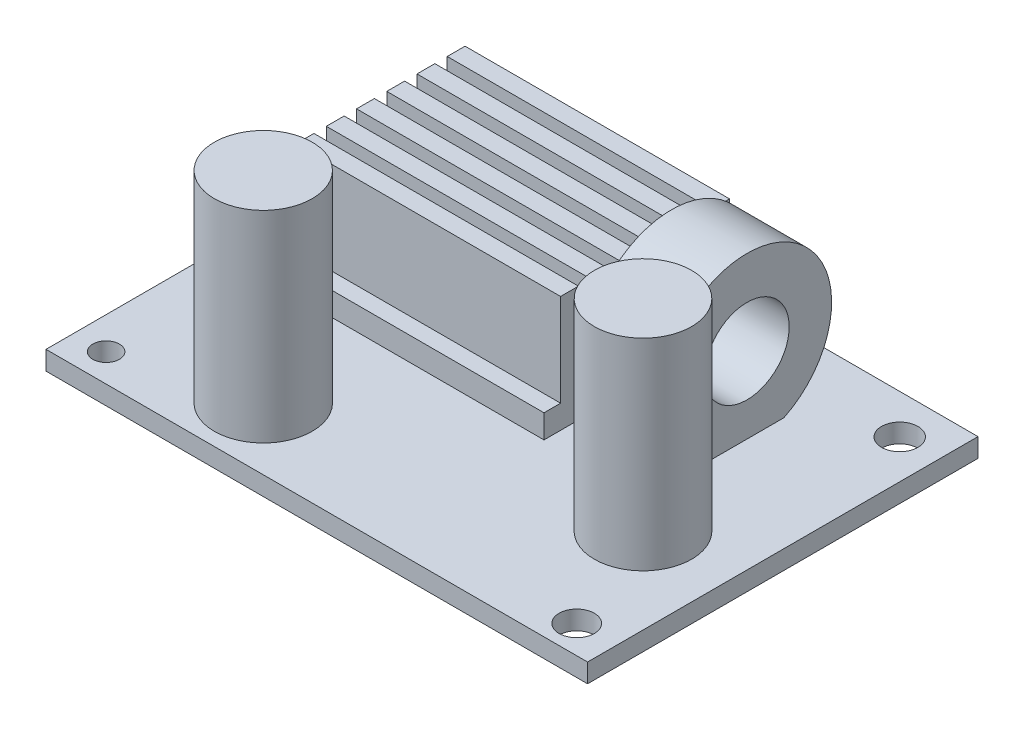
ISO-10303-21;
HEADER;
FILE_DESCRIPTION(('STEP AP214'),'2;1');
FILE_NAME('part.step','',(''),(''),'','','');
FILE_SCHEMA(('AUTOMOTIVE_DESIGN { 1 0 10303 214 1 1 1 1 }'));
ENDSEC;
DATA;
#1=APPLICATION_CONTEXT('core data for automotive mechanical design processes');
#2=APPLICATION_PROTOCOL_DEFINITION('international standard','automotive_design',2000,#1);
#3=PRODUCT_CONTEXT('',#1,'mechanical');
#4=PRODUCT('Part','Part','',(#3));
#5=PRODUCT_RELATED_PRODUCT_CATEGORY('part','',(#4));
#6=PRODUCT_DEFINITION_FORMATION('','',#4);
#7=PRODUCT_DEFINITION_CONTEXT('part definition',#1,'design');
#8=PRODUCT_DEFINITION('design','',#6,#7);
#9=PRODUCT_DEFINITION_SHAPE('','',#8);
#10=(LENGTH_UNIT() NAMED_UNIT(*) SI_UNIT(.MILLI.,.METRE.));
#11=(NAMED_UNIT(*) PLANE_ANGLE_UNIT() SI_UNIT($,.RADIAN.));
#12=(NAMED_UNIT(*) SI_UNIT($,.STERADIAN.) SOLID_ANGLE_UNIT());
#13=UNCERTAINTY_MEASURE_WITH_UNIT(LENGTH_MEASURE(1.E-05),#10,'distance_accuracy_value','');
#14=(GEOMETRIC_REPRESENTATION_CONTEXT(3) GLOBAL_UNCERTAINTY_ASSIGNED_CONTEXT((#13)) GLOBAL_UNIT_ASSIGNED_CONTEXT((#10,
#11,#12)) REPRESENTATION_CONTEXT('',''));
#15=CARTESIAN_POINT('',(0.,0.,0.));
#16=DIRECTION('',(0.,0.,1.));
#17=DIRECTION('',(1.,0.,0.));
#18=AXIS2_PLACEMENT_3D('',#15,#16,#17);
#19=CARTESIAN_POINT('',(0.,1.5,0.));
#20=DIRECTION('',(0.,1.,0.));
#21=DIRECTION('',(0.,0.,1.));
#22=AXIS2_PLACEMENT_3D('',#19,#20,#21);
#23=PLANE('',#22);
#24=DIRECTION('',(0.,0.,1.));
#25=VECTOR('',#24,1.);
#26=CARTESIAN_POINT('',(4.5,1.5,-10.0409728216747));
#27=LINE('',#26,#25);
#28=CARTESIAN_POINT('',(4.5,1.5,-12.7734342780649));
#29=VERTEX_POINT('',#28);
#30=CARTESIAN_POINT('',(4.5,1.5,1.95902717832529));
#31=VERTEX_POINT('',#30);
#32=EDGE_CURVE('E334',#29,#31,#27,.T.);
#33=ORIENTED_EDGE('',*,*,#32,.T.);
#34=DIRECTION('',(-1.,0.,0.));
#35=VECTOR('',#34,1.);
#36=CARTESIAN_POINT('',(4.5,1.5,1.95902717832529));
#37=LINE('',#36,#35);
#38=CARTESIAN_POINT('',(-16.5,1.5,1.95902717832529));
#39=VERTEX_POINT('',#38);
#40=EDGE_CURVE('E478',#31,#39,#37,.T.);
#41=ORIENTED_EDGE('',*,*,#40,.T.);
#42=DIRECTION('',(0.,0.,1.));
#43=VECTOR('',#42,1.);
#44=CARTESIAN_POINT('',(-16.5,1.5,-10.0409728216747));
#45=LINE('',#44,#43);
#46=CARTESIAN_POINT('',(-16.5,1.5,-12.7734342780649));
#47=VERTEX_POINT('',#46);
#48=EDGE_CURVE('E342',#47,#39,#45,.T.);
#49=ORIENTED_EDGE('',*,*,#48,.F.);
#50=DIRECTION('',(-1.,0.,0.));
#51=VECTOR('',#50,1.);
#52=CARTESIAN_POINT('',(4.5,1.5,-12.7734342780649));
#53=LINE('',#52,#51);
#54=EDGE_CURVE('E321',#29,#47,#53,.T.);
#55=ORIENTED_EDGE('',*,*,#54,.F.);
#56=EDGE_LOOP('',(#33,#41,#49,#55));
#57=FACE_BOUND('',#56,.T.);
#58=CARTESIAN_POINT('',(-9.17864919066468,1.5,10.5714292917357));
#59=DIRECTION('',(0.,1.,0.));
#60=DIRECTION('',(0.,0.,1.));
#61=AXIS2_PLACEMENT_3D('',#58,#59,#60);
#62=CIRCLE('',#61,3.88581381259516);
#63=CARTESIAN_POINT('',(-9.17864919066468,1.5,14.4572431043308));
#64=VERTEX_POINT('',#63);
#65=EDGE_CURVE('E318',#64,#64,#62,.T.);
#66=ORIENTED_EDGE('',*,*,#65,.F.);
#67=EDGE_LOOP('',(#66));
#68=FACE_BOUND('',#67,.T.);
#69=CARTESIAN_POINT('',(14.7015779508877,1.5,4.30105538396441));
#70=DIRECTION('',(0.,1.,0.));
#71=DIRECTION('',(0.,0.,1.));
#72=AXIS2_PLACEMENT_3D('',#69,#70,#71);
#73=CIRCLE('',#72,3.86516537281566);
#74=CARTESIAN_POINT('',(14.7015779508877,1.5,8.16622075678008));
#75=VERTEX_POINT('',#74);
#76=EDGE_CURVE('E312',#75,#75,#73,.T.);
#77=ORIENTED_EDGE('',*,*,#76,.F.);
#78=EDGE_LOOP('',(#77));
#79=FACE_BOUND('',#78,.T.);
#80=CARTESIAN_POINT('',(18.4124566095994,1.5,13.2740966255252));
#81=DIRECTION('',(0.,1.,0.));
#82=DIRECTION('',(0.,0.,1.));
#83=AXIS2_PLACEMENT_3D('',#80,#81,#82);
#84=CIRCLE('',#83,1.39691287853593);
#85=CARTESIAN_POINT('',(18.4124566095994,1.5,14.6710095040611));
#86=VERTEX_POINT('',#85);
#87=EDGE_CURVE('E297',#86,#86,#84,.T.);
#88=ORIENTED_EDGE('',*,*,#87,.F.);
#89=EDGE_LOOP('',(#88));
#90=FACE_BOUND('',#89,.T.);
#91=CARTESIAN_POINT('',(-18.9522512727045,1.5,-12.8228525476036));
#92=DIRECTION('',(0.,1.,0.));
#93=DIRECTION('',(0.,0.,1.));
#94=AXIS2_PLACEMENT_3D('',#91,#92,#93);
#95=CIRCLE('',#94,1.38062335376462);
#96=CARTESIAN_POINT('',(-18.9522512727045,1.5,-11.442229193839));
#97=VERTEX_POINT('',#96);
#98=EDGE_CURVE('E280',#97,#97,#95,.T.);
#99=ORIENTED_EDGE('',*,*,#98,.F.);
#100=EDGE_LOOP('',(#99));
#101=FACE_BOUND('',#100,.T.);
#102=DIRECTION('',(0.,0.,1.));
#103=VECTOR('',#102,1.);
#104=CARTESIAN_POINT('',(-21.5,1.5,-15.5));
#105=LINE('',#104,#103);
#106=CARTESIAN_POINT('',(-21.5,1.5,-15.5));
#107=VERTEX_POINT('',#106);
#108=CARTESIAN_POINT('',(-21.5,1.5,15.5));
#109=VERTEX_POINT('',#108);
#110=EDGE_CURVE('E272',#107,#109,#105,.T.);
#111=ORIENTED_EDGE('',*,*,#110,.T.);
#112=DIRECTION('',(1.,0.,0.));
#113=VECTOR('',#112,1.);
#114=CARTESIAN_POINT('',(-21.5,1.5,15.5));
#115=LINE('',#114,#113);
#116=CARTESIAN_POINT('',(21.5,1.5,15.5));
#117=VERTEX_POINT('',#116);
#118=EDGE_CURVE('E284',#109,#117,#115,.T.);
#119=ORIENTED_EDGE('',*,*,#118,.T.);
#120=DIRECTION('',(0.,0.,-1.));
#121=VECTOR('',#120,1.);
#122=CARTESIAN_POINT('',(21.5,1.5,-15.5));
#123=LINE('',#122,#121);
#124=CARTESIAN_POINT('',(21.5,1.5,-15.5));
#125=VERTEX_POINT('',#124);
#126=EDGE_CURVE('E282',#117,#125,#123,.T.);
#127=ORIENTED_EDGE('',*,*,#126,.T.);
#128=DIRECTION('',(-1.,0.,0.));
#129=VECTOR('',#128,1.);
#130=CARTESIAN_POINT('',(-21.5,1.5,-15.5));
#131=LINE('',#130,#129);
#132=EDGE_CURVE('E269',#125,#107,#131,.T.);
#133=ORIENTED_EDGE('',*,*,#132,.T.);
#134=EDGE_LOOP('',(#111,#119,#127,#133));
#135=FACE_BOUND('',#134,.T.);
#136=CARTESIAN_POINT('',(-18.9522512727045,1.5,13.2740966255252));
#137=DIRECTION('',(0.,1.,0.));
#138=DIRECTION('',(0.,0.,1.));
#139=AXIS2_PLACEMENT_3D('',#136,#137,#138);
#140=CIRCLE('',#139,1.05290284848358);
#141=CARTESIAN_POINT('',(-18.9522512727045,1.5,14.3269994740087));
#142=VERTEX_POINT('',#141);
#143=EDGE_CURVE('E291',#142,#142,#140,.T.);
#144=ORIENTED_EDGE('',*,*,#143,.F.);
#145=EDGE_LOOP('',(#144));
#146=FACE_BOUND('',#145,.T.);
#147=CARTESIAN_POINT('',(18.4124566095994,1.5,-12.3716084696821));
#148=DIRECTION('',(0.,1.,0.));
#149=DIRECTION('',(0.,0.,1.));
#150=AXIS2_PLACEMENT_3D('',#147,#148,#149);
#151=CIRCLE('',#150,1.44468594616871);
#152=CARTESIAN_POINT('',(18.4124566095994,1.5,-10.9269225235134));
#153=VERTEX_POINT('',#152);
#154=EDGE_CURVE('E303',#153,#153,#151,.T.);
#155=ORIENTED_EDGE('',*,*,#154,.F.);
#156=EDGE_LOOP('',(#155));
#157=FACE_BOUND('',#156,.T.);
#158=DIRECTION('',(0.,0.,-1.));
#159=VECTOR('',#158,1.);
#160=CARTESIAN_POINT('',(6.5,1.5,0.));
#161=LINE('',#160,#159);
#162=CARTESIAN_POINT('',(6.5,1.5,-3.22295721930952));
#163=VERTEX_POINT('',#162);
#164=CARTESIAN_POINT('',(6.5,1.5,-9.0895799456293));
#165=VERTEX_POINT('',#164);
#166=EDGE_CURVE('E248',#163,#165,#161,.T.);
#167=ORIENTED_EDGE('',*,*,#166,.T.);
#168=DIRECTION('',(-1.,0.,0.));
#169=VECTOR('',#168,1.);
#170=CARTESIAN_POINT('',(12.5,1.5,-9.0895799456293));
#171=LINE('',#170,#169);
#172=CARTESIAN_POINT('',(12.5,1.5,-9.0895799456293));
#173=VERTEX_POINT('',#172);
#174=EDGE_CURVE('E11',#165,#173,#171,.F.);
#175=ORIENTED_EDGE('',*,*,#174,.T.);
#176=DIRECTION('',(0.,0.,-1.));
#177=VECTOR('',#176,1.);
#178=CARTESIAN_POINT('',(12.5,1.5,0.));
#179=LINE('',#178,#177);
#180=CARTESIAN_POINT('',(12.5,1.5,-3.22295721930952));
#181=VERTEX_POINT('',#180);
#182=EDGE_CURVE('E40',#181,#173,#179,.T.);
#183=ORIENTED_EDGE('',*,*,#182,.F.);
#184=DIRECTION('',(-1.,0.,0.));
#185=VECTOR('',#184,1.);
#186=CARTESIAN_POINT('',(12.5,1.5,-3.22295721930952));
#187=LINE('',#186,#185);
#188=EDGE_CURVE('E241',#181,#163,#187,.T.);
#189=ORIENTED_EDGE('',*,*,#188,.T.);
#190=EDGE_LOOP('',(#167,#175,#183,#189));
#191=FACE_BOUND('',#190,.T.);
#192=ADVANCED_FACE('F32',(#57,#68,#79,#90,#101,#135,#146,#157,#191),#23,.T.);
#193=CARTESIAN_POINT('',(0.,0.,0.));
#194=DIRECTION('',(0.,1.,0.));
#195=DIRECTION('',(0.,0.,1.));
#196=AXIS2_PLACEMENT_3D('',#193,#194,#195);
#197=PLANE('',#196);
#198=DIRECTION('',(0.,0.,1.));
#199=VECTOR('',#198,1.);
#200=CARTESIAN_POINT('',(-21.5,0.,-15.5));
#201=LINE('',#200,#199);
#202=CARTESIAN_POINT('',(-21.5,0.,-15.5));
#203=VERTEX_POINT('',#202);
#204=CARTESIAN_POINT('',(-21.5,0.,15.5));
#205=VERTEX_POINT('',#204);
#206=EDGE_CURVE('E277',#203,#205,#201,.T.);
#207=ORIENTED_EDGE('',*,*,#206,.F.);
#208=DIRECTION('',(-1.,0.,0.));
#209=VECTOR('',#208,1.);
#210=CARTESIAN_POINT('',(-21.5,0.,-15.5));
#211=LINE('',#210,#209);
#212=CARTESIAN_POINT('',(21.5,0.,-15.5));
#213=VERTEX_POINT('',#212);
#214=EDGE_CURVE('E270',#213,#203,#211,.T.);
#215=ORIENTED_EDGE('',*,*,#214,.F.);
#216=DIRECTION('',(0.,0.,-1.));
#217=VECTOR('',#216,1.);
#218=CARTESIAN_POINT('',(21.5,0.,-15.5));
#219=LINE('',#218,#217);
#220=CARTESIAN_POINT('',(21.5,0.,15.5));
#221=VERTEX_POINT('',#220);
#222=EDGE_CURVE('E273',#221,#213,#219,.T.);
#223=ORIENTED_EDGE('',*,*,#222,.F.);
#224=DIRECTION('',(1.,0.,0.));
#225=VECTOR('',#224,1.);
#226=CARTESIAN_POINT('',(-21.5,0.,15.5));
#227=LINE('',#226,#225);
#228=EDGE_CURVE('E275',#205,#221,#227,.T.);
#229=ORIENTED_EDGE('',*,*,#228,.F.);
#230=EDGE_LOOP('',(#207,#215,#223,#229));
#231=FACE_BOUND('',#230,.T.);
#232=CARTESIAN_POINT('',(-18.9522512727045,0.,-12.8228525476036));
#233=DIRECTION('',(0.,1.,0.));
#234=DIRECTION('',(0.,0.,1.));
#235=AXIS2_PLACEMENT_3D('',#232,#233,#234);
#236=CIRCLE('',#235,1.38062335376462);
#237=CARTESIAN_POINT('',(-18.9522512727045,0.,-11.442229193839));
#238=VERTEX_POINT('',#237);
#239=EDGE_CURVE('E288',#238,#238,#236,.T.);
#240=ORIENTED_EDGE('',*,*,#239,.T.);
#241=EDGE_LOOP('',(#240));
#242=FACE_BOUND('',#241,.T.);
#243=CARTESIAN_POINT('',(-18.9522512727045,0.,13.2740966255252));
#244=DIRECTION('',(0.,1.,0.));
#245=DIRECTION('',(0.,0.,1.));
#246=AXIS2_PLACEMENT_3D('',#243,#244,#245);
#247=CIRCLE('',#246,1.05290284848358);
#248=CARTESIAN_POINT('',(-18.9522512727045,0.,14.3269994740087));
#249=VERTEX_POINT('',#248);
#250=EDGE_CURVE('E294',#249,#249,#247,.T.);
#251=ORIENTED_EDGE('',*,*,#250,.T.);
#252=EDGE_LOOP('',(#251));
#253=FACE_BOUND('',#252,.T.);
#254=CARTESIAN_POINT('',(18.4124566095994,0.,13.2740966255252));
#255=DIRECTION('',(0.,1.,0.));
#256=DIRECTION('',(0.,0.,1.));
#257=AXIS2_PLACEMENT_3D('',#254,#255,#256);
#258=CIRCLE('',#257,1.39691287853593);
#259=CARTESIAN_POINT('',(18.4124566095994,0.,14.6710095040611));
#260=VERTEX_POINT('',#259);
#261=EDGE_CURVE('E300',#260,#260,#258,.T.);
#262=ORIENTED_EDGE('',*,*,#261,.T.);
#263=EDGE_LOOP('',(#262));
#264=FACE_BOUND('',#263,.T.);
#265=CARTESIAN_POINT('',(18.4124566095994,0.,-12.3716084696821));
#266=DIRECTION('',(0.,1.,0.));
#267=DIRECTION('',(0.,0.,1.));
#268=AXIS2_PLACEMENT_3D('',#265,#266,#267);
#269=CIRCLE('',#268,1.44468594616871);
#270=CARTESIAN_POINT('',(18.4124566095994,0.,-10.9269225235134));
#271=VERTEX_POINT('',#270);
#272=EDGE_CURVE('E306',#271,#271,#269,.T.);
#273=ORIENTED_EDGE('',*,*,#272,.T.);
#274=EDGE_LOOP('',(#273));
#275=FACE_BOUND('',#274,.T.);
#276=ADVANCED_FACE('F541',(#231,#242,#253,#264,#275),#197,.F.);
#277=CARTESIAN_POINT('',(-21.5,1.5,-15.5));
#278=DIRECTION('',(1.,0.,0.));
#279=DIRECTION('',(0.,0.,-1.));
#280=AXIS2_PLACEMENT_3D('',#277,#278,#279);
#281=PLANE('',#280);
#282=ORIENTED_EDGE('',*,*,#206,.T.);
#283=DIRECTION('',(0.,-1.,0.));
#284=VECTOR('',#283,1.);
#285=CARTESIAN_POINT('',(-21.5,1.5,15.5));
#286=LINE('',#285,#284);
#287=EDGE_CURVE('E249',#109,#205,#286,.T.);
#288=ORIENTED_EDGE('',*,*,#287,.F.);
#289=ORIENTED_EDGE('',*,*,#110,.F.);
#290=DIRECTION('',(0.,-1.,0.));
#291=VECTOR('',#290,1.);
#292=CARTESIAN_POINT('',(-21.5,1.5,-15.5));
#293=LINE('',#292,#291);
#294=EDGE_CURVE('E266',#107,#203,#293,.T.);
#295=ORIENTED_EDGE('',*,*,#294,.T.);
#296=EDGE_LOOP('',(#282,#288,#289,#295));
#297=FACE_BOUND('',#296,.T.);
#298=ADVANCED_FACE('F34',(#297),#281,.F.);
#299=CARTESIAN_POINT('',(-21.5,1.5,15.5));
#300=DIRECTION('',(0.,0.,-1.));
#301=DIRECTION('',(-1.,0.,0.));
#302=AXIS2_PLACEMENT_3D('',#299,#300,#301);
#303=PLANE('',#302);
#304=ORIENTED_EDGE('',*,*,#228,.T.);
#305=DIRECTION('',(0.,-1.,0.));
#306=VECTOR('',#305,1.);
#307=CARTESIAN_POINT('',(21.5,1.5,15.5));
#308=LINE('',#307,#306);
#309=EDGE_CURVE('E260',#117,#221,#308,.T.);
#310=ORIENTED_EDGE('',*,*,#309,.F.);
#311=ORIENTED_EDGE('',*,*,#118,.F.);
#312=ORIENTED_EDGE('',*,*,#287,.T.);
#313=EDGE_LOOP('',(#304,#310,#311,#312));
#314=FACE_BOUND('',#313,.T.);
#315=ADVANCED_FACE('F560',(#314),#303,.F.);
#316=CARTESIAN_POINT('',(21.5,1.5,-15.5));
#317=DIRECTION('',(-1.,0.,0.));
#318=DIRECTION('',(0.,0.,1.));
#319=AXIS2_PLACEMENT_3D('',#316,#317,#318);
#320=PLANE('',#319);
#321=ORIENTED_EDGE('',*,*,#222,.T.);
#322=DIRECTION('',(0.,-1.,0.));
#323=VECTOR('',#322,1.);
#324=CARTESIAN_POINT('',(21.5,1.5,-15.5));
#325=LINE('',#324,#323);
#326=EDGE_CURVE('E263',#125,#213,#325,.T.);
#327=ORIENTED_EDGE('',*,*,#326,.F.);
#328=ORIENTED_EDGE('',*,*,#126,.F.);
#329=ORIENTED_EDGE('',*,*,#309,.T.);
#330=EDGE_LOOP('',(#321,#327,#328,#329));
#331=FACE_BOUND('',#330,.T.);
#332=ADVANCED_FACE('F557',(#331),#320,.F.);
#333=CARTESIAN_POINT('',(-21.5,1.5,-15.5));
#334=DIRECTION('',(0.,0.,1.));
#335=DIRECTION('',(1.,0.,0.));
#336=AXIS2_PLACEMENT_3D('',#333,#334,#335);
#337=PLANE('',#336);
#338=ORIENTED_EDGE('',*,*,#214,.T.);
#339=ORIENTED_EDGE('',*,*,#294,.F.);
#340=ORIENTED_EDGE('',*,*,#132,.F.);
#341=ORIENTED_EDGE('',*,*,#326,.T.);
#342=EDGE_LOOP('',(#338,#339,#340,#341));
#343=FACE_BOUND('',#342,.T.);
#344=ADVANCED_FACE('F554',(#343),#337,.F.);
#345=CARTESIAN_POINT('',(-18.9522512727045,1.5,-12.8228525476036));
#346=DIRECTION('',(0.,-1.,0.));
#347=DIRECTION('',(0.,0.,-1.));
#348=AXIS2_PLACEMENT_3D('',#345,#346,#347);
#349=CYLINDRICAL_SURFACE('',#348,1.38062335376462);
#350=ORIENTED_EDGE('',*,*,#98,.T.);
#351=EDGE_LOOP('',(#350));
#352=FACE_BOUND('',#351,.T.);
#353=ORIENTED_EDGE('',*,*,#239,.F.);
#354=EDGE_LOOP('',(#353));
#355=FACE_BOUND('',#354,.T.);
#356=ADVANCED_FACE('F551',(#352,#355),#349,.F.);
#357=CARTESIAN_POINT('',(-18.9522512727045,1.5,13.2740966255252));
#358=DIRECTION('',(0.,-1.,0.));
#359=DIRECTION('',(0.,0.,-1.));
#360=AXIS2_PLACEMENT_3D('',#357,#358,#359);
#361=CYLINDRICAL_SURFACE('',#360,1.05290284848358);
#362=ORIENTED_EDGE('',*,*,#143,.T.);
#363=EDGE_LOOP('',(#362));
#364=FACE_BOUND('',#363,.T.);
#365=ORIENTED_EDGE('',*,*,#250,.F.);
#366=EDGE_LOOP('',(#365));
#367=FACE_BOUND('',#366,.T.);
#368=ADVANCED_FACE('F600',(#364,#367),#361,.F.);
#369=CARTESIAN_POINT('',(18.4124566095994,1.5,13.2740966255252));
#370=DIRECTION('',(0.,-1.,0.));
#371=DIRECTION('',(0.,0.,-1.));
#372=AXIS2_PLACEMENT_3D('',#369,#370,#371);
#373=CYLINDRICAL_SURFACE('',#372,1.39691287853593);
#374=ORIENTED_EDGE('',*,*,#87,.T.);
#375=EDGE_LOOP('',(#374));
#376=FACE_BOUND('',#375,.T.);
#377=ORIENTED_EDGE('',*,*,#261,.F.);
#378=EDGE_LOOP('',(#377));
#379=FACE_BOUND('',#378,.T.);
#380=ADVANCED_FACE('F589',(#376,#379),#373,.F.);
#381=CARTESIAN_POINT('',(18.4124566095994,1.5,-12.3716084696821));
#382=DIRECTION('',(0.,-1.,0.));
#383=DIRECTION('',(0.,0.,-1.));
#384=AXIS2_PLACEMENT_3D('',#381,#382,#383);
#385=CYLINDRICAL_SURFACE('',#384,1.44468594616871);
#386=ORIENTED_EDGE('',*,*,#154,.T.);
#387=EDGE_LOOP('',(#386));
#388=FACE_BOUND('',#387,.T.);
#389=ORIENTED_EDGE('',*,*,#272,.F.);
#390=EDGE_LOOP('',(#389));
#391=FACE_BOUND('',#390,.T.);
#392=ADVANCED_FACE('F585',(#388,#391),#385,.F.);
#393=CARTESIAN_POINT('',(14.7015779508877,17.5,4.30105538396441));
#394=DIRECTION('',(0.,-1.,0.));
#395=DIRECTION('',(0.,0.,-1.));
#396=AXIS2_PLACEMENT_3D('',#393,#394,#395);
#397=CYLINDRICAL_SURFACE('',#396,3.86516537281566);
#398=CARTESIAN_POINT('',(14.7015779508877,17.5,4.30105538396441));
#399=DIRECTION('',(0.,1.,0.));
#400=DIRECTION('',(0.,0.,1.));
#401=AXIS2_PLACEMENT_3D('',#398,#399,#400);
#402=CIRCLE('',#401,3.86516537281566);
#403=CARTESIAN_POINT('',(14.7015779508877,17.5,8.16622075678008));
#404=VERTEX_POINT('',#403);
#405=EDGE_CURVE('E309',#404,#404,#402,.T.);
#406=ORIENTED_EDGE('',*,*,#405,.F.);
#407=EDGE_LOOP('',(#406));
#408=FACE_BOUND('',#407,.T.);
#409=ORIENTED_EDGE('',*,*,#76,.T.);
#410=EDGE_LOOP('',(#409));
#411=FACE_BOUND('',#410,.T.);
#412=ADVANCED_FACE('F588',(#408,#411),#397,.T.);
#413=CARTESIAN_POINT('',(14.7015779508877,17.5,4.30105538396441));
#414=DIRECTION('',(0.,1.,0.));
#415=DIRECTION('',(0.,0.,1.));
#416=AXIS2_PLACEMENT_3D('',#413,#414,#415);
#417=PLANE('',#416);
#418=ORIENTED_EDGE('',*,*,#405,.T.);
#419=EDGE_LOOP('',(#418));
#420=FACE_BOUND('',#419,.T.);
#421=ADVANCED_FACE('F597',(#420),#417,.T.);
#422=CARTESIAN_POINT('',(-9.17864919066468,17.5,10.5714292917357));
#423=DIRECTION('',(0.,-1.,0.));
#424=DIRECTION('',(0.,0.,-1.));
#425=AXIS2_PLACEMENT_3D('',#422,#423,#424);
#426=CYLINDRICAL_SURFACE('',#425,3.88581381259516);
#427=CARTESIAN_POINT('',(-9.17864919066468,17.5,10.5714292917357));
#428=DIRECTION('',(0.,1.,0.));
#429=DIRECTION('',(0.,0.,1.));
#430=AXIS2_PLACEMENT_3D('',#427,#428,#429);
#431=CIRCLE('',#430,3.88581381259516);
#432=CARTESIAN_POINT('',(-9.17864919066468,17.5,14.4572431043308));
#433=VERTEX_POINT('',#432);
#434=EDGE_CURVE('E315',#433,#433,#431,.T.);
#435=ORIENTED_EDGE('',*,*,#434,.F.);
#436=EDGE_LOOP('',(#435));
#437=FACE_BOUND('',#436,.T.);
#438=ORIENTED_EDGE('',*,*,#65,.T.);
#439=EDGE_LOOP('',(#438));
#440=FACE_BOUND('',#439,.T.);
#441=ADVANCED_FACE('F678',(#437,#440),#426,.T.);
#442=CARTESIAN_POINT('',(-9.17864919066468,17.5,10.5714292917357));
#443=DIRECTION('',(0.,1.,0.));
#444=DIRECTION('',(0.,0.,1.));
#445=AXIS2_PLACEMENT_3D('',#442,#443,#444);
#446=PLANE('',#445);
#447=ORIENTED_EDGE('',*,*,#434,.T.);
#448=EDGE_LOOP('',(#447));
#449=FACE_BOUND('',#448,.T.);
#450=ADVANCED_FACE('F686',(#449),#446,.T.);
#451=CARTESIAN_POINT('',(4.5,1.5,-12.7734342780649));
#452=DIRECTION('',(0.,0.,-1.));
#453=DIRECTION('',(-1.,0.,0.));
#454=AXIS2_PLACEMENT_3D('',#451,#452,#453);
#455=PLANE('',#454);
#456=DIRECTION('',(0.,-1.,0.));
#457=VECTOR('',#456,1.);
#458=CARTESIAN_POINT('',(-16.5,1.5,-12.7734342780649));
#459=LINE('',#458,#457);
#460=CARTESIAN_POINT('',(-16.5,10.7088127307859,-12.7734342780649));
#461=VERTEX_POINT('',#460);
#462=EDGE_CURVE('E55',#461,#47,#459,.T.);
#463=ORIENTED_EDGE('',*,*,#462,.F.);
#464=DIRECTION('',(-1.,0.,0.));
#465=VECTOR('',#464,1.);
#466=CARTESIAN_POINT('',(4.5,10.7088127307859,-12.7734342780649));
#467=LINE('',#466,#465);
#468=CARTESIAN_POINT('',(4.5,10.7088127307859,-12.7734342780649));
#469=VERTEX_POINT('',#468);
#470=EDGE_CURVE('E330',#469,#461,#467,.T.);
#471=ORIENTED_EDGE('',*,*,#470,.F.);
#472=DIRECTION('',(0.,-1.,0.));
#473=VECTOR('',#472,1.);
#474=CARTESIAN_POINT('',(4.5,1.5,-12.7734342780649));
#475=LINE('',#474,#473);
#476=EDGE_CURVE('E328',#469,#29,#475,.T.);
#477=ORIENTED_EDGE('',*,*,#476,.T.);
#478=ORIENTED_EDGE('',*,*,#54,.T.);
#479=EDGE_LOOP('',(#463,#471,#477,#478));
#480=FACE_BOUND('',#479,.T.);
#481=ADVANCED_FACE('F695',(#480),#455,.T.);
#482=CARTESIAN_POINT('',(4.5,10.7088127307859,-12.7734342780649));
#483=DIRECTION('',(0.,1.,0.));
#484=DIRECTION('',(0.,0.,1.));
#485=AXIS2_PLACEMENT_3D('',#482,#483,#484);
#486=PLANE('',#485);
#487=DIRECTION('',(0.,0.,-1.));
#488=VECTOR('',#487,1.);
#489=CARTESIAN_POINT('',(-16.5,10.7088127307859,-12.7734342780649));
#490=LINE('',#489,#488);
#491=CARTESIAN_POINT('',(-16.5,10.7088127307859,-11.3578217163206));
#492=VERTEX_POINT('',#491);
#493=EDGE_CURVE('E335',#492,#461,#490,.T.);
#494=ORIENTED_EDGE('',*,*,#493,.F.);
#495=DIRECTION('',(-1.,0.,0.));
#496=VECTOR('',#495,1.);
#497=CARTESIAN_POINT('',(4.5,10.7088127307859,-11.3578217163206));
#498=LINE('',#497,#496);
#499=CARTESIAN_POINT('',(4.5,10.7088127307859,-11.3578217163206));
#500=VERTEX_POINT('',#499);
#501=EDGE_CURVE('E327',#500,#492,#498,.T.);
#502=ORIENTED_EDGE('',*,*,#501,.F.);
#503=DIRECTION('',(0.,0.,-1.));
#504=VECTOR('',#503,1.);
#505=CARTESIAN_POINT('',(4.5,10.7088127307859,-12.7734342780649));
#506=LINE('',#505,#504);
#507=EDGE_CURVE('E347',#500,#469,#506,.T.);
#508=ORIENTED_EDGE('',*,*,#507,.T.);
#509=ORIENTED_EDGE('',*,*,#470,.T.);
#510=EDGE_LOOP('',(#494,#502,#508,#509));
#511=FACE_BOUND('',#510,.T.);
#512=ADVANCED_FACE('F704',(#511),#486,.T.);
#513=CARTESIAN_POINT('',(4.5,10.7088127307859,-11.3578217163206));
#514=DIRECTION('',(0.,0.,1.));
#515=DIRECTION('',(1.,0.,0.));
#516=AXIS2_PLACEMENT_3D('',#513,#514,#515);
#517=PLANE('',#516);
#518=DIRECTION('',(0.,1.,0.));
#519=VECTOR('',#518,1.);
#520=CARTESIAN_POINT('',(-16.5,10.7088127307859,-11.3578217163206));
#521=LINE('',#520,#519);
#522=CARTESIAN_POINT('',(-16.5,3.36738014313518,-11.3578217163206));
#523=VERTEX_POINT('',#522);
#524=EDGE_CURVE('E337',#523,#492,#521,.T.);
#525=ORIENTED_EDGE('',*,*,#524,.F.);
#526=DIRECTION('',(-1.,0.,0.));
#527=VECTOR('',#526,1.);
#528=CARTESIAN_POINT('',(4.5,3.36738014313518,-11.3578217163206));
#529=LINE('',#528,#527);
#530=CARTESIAN_POINT('',(4.5,3.36738014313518,-11.3578217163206));
#531=VERTEX_POINT('',#530);
#532=EDGE_CURVE('E324',#531,#523,#529,.T.);
#533=ORIENTED_EDGE('',*,*,#532,.F.);
#534=DIRECTION('',(0.,1.,0.));
#535=VECTOR('',#534,1.);
#536=CARTESIAN_POINT('',(4.5,10.7088127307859,-11.3578217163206));
#537=LINE('',#536,#535);
#538=EDGE_CURVE('E350',#531,#500,#537,.T.);
#539=ORIENTED_EDGE('',*,*,#538,.T.);
#540=ORIENTED_EDGE('',*,*,#501,.T.);
#541=EDGE_LOOP('',(#525,#533,#539,#540));
#542=FACE_BOUND('',#541,.T.);
#543=ADVANCED_FACE('F713',(#542),#517,.T.);
#544=CARTESIAN_POINT('',(4.5,3.36738014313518,-11.3578217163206));
#545=DIRECTION('',(0.,1.,0.));
#546=DIRECTION('',(0.,0.,1.));
#547=AXIS2_PLACEMENT_3D('',#544,#545,#546);
#548=PLANE('',#547);
#549=DIRECTION('',(-1.,0.,0.));
#550=VECTOR('',#549,1.);
#551=CARTESIAN_POINT('',(4.5,3.36738014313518,-10.3734342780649));
#552=LINE('',#551,#550);
#553=CARTESIAN_POINT('',(4.5,3.36738014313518,-10.3734342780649));
#554=VERTEX_POINT('',#553);
#555=CARTESIAN_POINT('',(-16.5,3.36738014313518,-10.3734342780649));
#556=VERTEX_POINT('',#555);
#557=EDGE_CURVE('E344',#554,#556,#552,.T.);
#558=ORIENTED_EDGE('',*,*,#557,.F.);
#559=DIRECTION('',(0.,0.,-1.));
#560=VECTOR('',#559,1.);
#561=CARTESIAN_POINT('',(4.5,3.36738014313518,-11.3578217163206));
#562=LINE('',#561,#560);
#563=EDGE_CURVE('E353',#554,#531,#562,.T.);
#564=ORIENTED_EDGE('',*,*,#563,.T.);
#565=ORIENTED_EDGE('',*,*,#532,.T.);
#566=DIRECTION('',(0.,0.,-1.));
#567=VECTOR('',#566,1.);
#568=CARTESIAN_POINT('',(-16.5,3.36738014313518,-11.3578217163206));
#569=LINE('',#568,#567);
#570=EDGE_CURVE('E340',#556,#523,#569,.T.);
#571=ORIENTED_EDGE('',*,*,#570,.F.);
#572=EDGE_LOOP('',(#558,#564,#565,#571));
#573=FACE_BOUND('',#572,.T.);
#574=ADVANCED_FACE('F722',(#573),#548,.T.);
#575=CARTESIAN_POINT('',(4.5,0.,0.));
#576=DIRECTION('',(1.,0.,0.));
#577=DIRECTION('',(0.,0.,-1.));
#578=AXIS2_PLACEMENT_3D('',#575,#576,#577);
#579=PLANE('',#578);
#580=ORIENTED_EDGE('',*,*,#563,.F.);
#581=DIRECTION('',(0.,-1.,0.));
#582=VECTOR('',#581,1.);
#583=CARTESIAN_POINT('',(4.5,1.5,-10.3734342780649));
#584=LINE('',#583,#582);
#585=CARTESIAN_POINT('',(4.5,10.7088127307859,-10.3734342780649));
#586=VERTEX_POINT('',#585);
#587=EDGE_CURVE('E362',#586,#554,#584,.T.);
#588=ORIENTED_EDGE('',*,*,#587,.F.);
#589=DIRECTION('',(0.,0.,-1.));
#590=VECTOR('',#589,1.);
#591=CARTESIAN_POINT('',(4.5,10.7088127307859,-10.3734342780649));
#592=LINE('',#591,#590);
#593=CARTESIAN_POINT('',(4.5,10.7088127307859,-8.95782171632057));
#594=VERTEX_POINT('',#593);
#595=EDGE_CURVE('E379',#594,#586,#592,.T.);
#596=ORIENTED_EDGE('',*,*,#595,.F.);
#597=DIRECTION('',(0.,1.,0.));
#598=VECTOR('',#597,1.);
#599=CARTESIAN_POINT('',(4.5,10.7088127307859,-8.95782171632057));
#600=LINE('',#599,#598);
#601=CARTESIAN_POINT('',(4.5,3.36738014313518,-8.95782171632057));
#602=VERTEX_POINT('',#601);
#603=EDGE_CURVE('E382',#602,#594,#600,.T.);
#604=ORIENTED_EDGE('',*,*,#603,.F.);
#605=DIRECTION('',(0.,0.,-1.));
#606=VECTOR('',#605,1.);
#607=CARTESIAN_POINT('',(4.5,3.36738014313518,-8.95782171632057));
#608=LINE('',#607,#606);
#609=CARTESIAN_POINT('',(4.5,3.36738014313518,-7.97343427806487));
#610=VERTEX_POINT('',#609);
#611=EDGE_CURVE('E368',#610,#602,#608,.T.);
#612=ORIENTED_EDGE('',*,*,#611,.F.);
#613=DIRECTION('',(0.,-1.,0.));
#614=VECTOR('',#613,1.);
#615=CARTESIAN_POINT('',(4.5,1.5,-7.97343427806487));
#616=LINE('',#615,#614);
#617=CARTESIAN_POINT('',(4.5,10.7088127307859,-7.97343427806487));
#618=VERTEX_POINT('',#617);
#619=EDGE_CURVE('E392',#618,#610,#616,.T.);
#620=ORIENTED_EDGE('',*,*,#619,.F.);
#621=DIRECTION('',(0.,0.,-1.));
#622=VECTOR('',#621,1.);
#623=CARTESIAN_POINT('',(4.5,10.7088127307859,-7.97343427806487));
#624=LINE('',#623,#622);
#625=CARTESIAN_POINT('',(4.5,10.7088127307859,-6.55782171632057));
#626=VERTEX_POINT('',#625);
#627=EDGE_CURVE('E409',#626,#618,#624,.T.);
#628=ORIENTED_EDGE('',*,*,#627,.F.);
#629=DIRECTION('',(0.,1.,0.));
#630=VECTOR('',#629,1.);
#631=CARTESIAN_POINT('',(4.5,10.7088127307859,-6.55782171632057));
#632=LINE('',#631,#630);
#633=CARTESIAN_POINT('',(4.5,3.36738014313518,-6.55782171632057));
#634=VERTEX_POINT('',#633);
#635=EDGE_CURVE('E412',#634,#626,#632,.T.);
#636=ORIENTED_EDGE('',*,*,#635,.F.);
#637=DIRECTION('',(0.,0.,-1.));
#638=VECTOR('',#637,1.);
#639=CARTESIAN_POINT('',(4.5,3.36738014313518,-6.55782171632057));
#640=LINE('',#639,#638);
#641=CARTESIAN_POINT('',(4.5,3.36738014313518,-5.57343427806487));
#642=VERTEX_POINT('',#641);
#643=EDGE_CURVE('E398',#642,#634,#640,.T.);
#644=ORIENTED_EDGE('',*,*,#643,.F.);
#645=DIRECTION('',(0.,-1.,0.));
#646=VECTOR('',#645,1.);
#647=CARTESIAN_POINT('',(4.5,1.5,-5.57343427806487));
#648=LINE('',#647,#646);
#649=CARTESIAN_POINT('',(4.5,10.7088127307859,-5.57343427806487));
#650=VERTEX_POINT('',#649);
#651=EDGE_CURVE('E422',#650,#642,#648,.T.);
#652=ORIENTED_EDGE('',*,*,#651,.F.);
#653=DIRECTION('',(0.,0.,-1.));
#654=VECTOR('',#653,1.);
#655=CARTESIAN_POINT('',(4.5,10.7088127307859,-5.57343427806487));
#656=LINE('',#655,#654);
#657=CARTESIAN_POINT('',(4.5,10.7088127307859,-4.15782171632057));
#658=VERTEX_POINT('',#657);
#659=EDGE_CURVE('E439',#658,#650,#656,.T.);
#660=ORIENTED_EDGE('',*,*,#659,.F.);
#661=DIRECTION('',(0.,1.,0.));
#662=VECTOR('',#661,1.);
#663=CARTESIAN_POINT('',(4.5,10.7088127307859,-4.15782171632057));
#664=LINE('',#663,#662);
#665=CARTESIAN_POINT('',(4.5,3.36738014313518,-4.15782171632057));
#666=VERTEX_POINT('',#665);
#667=EDGE_CURVE('E442',#666,#658,#664,.T.);
#668=ORIENTED_EDGE('',*,*,#667,.F.);
#669=DIRECTION('',(0.,0.,-1.));
#670=VECTOR('',#669,1.);
#671=CARTESIAN_POINT('',(4.5,3.36738014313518,-4.15782171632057));
#672=LINE('',#671,#670);
#673=CARTESIAN_POINT('',(4.5,3.36738014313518,-3.17343427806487));
#674=VERTEX_POINT('',#673);
#675=EDGE_CURVE('E428',#674,#666,#672,.T.);
#676=ORIENTED_EDGE('',*,*,#675,.F.);
#677=DIRECTION('',(0.,-1.,0.));
#678=VECTOR('',#677,1.);
#679=CARTESIAN_POINT('',(4.5,1.5,-3.17343427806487));
#680=LINE('',#679,#678);
#681=CARTESIAN_POINT('',(4.5,10.7088127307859,-3.17343427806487));
#682=VERTEX_POINT('',#681);
#683=EDGE_CURVE('E452',#682,#674,#680,.T.);
#684=ORIENTED_EDGE('',*,*,#683,.F.);
#685=DIRECTION('',(0.,0.,-1.));
#686=VECTOR('',#685,1.);
#687=CARTESIAN_POINT('',(4.5,10.7088127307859,-3.17343427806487));
#688=LINE('',#687,#686);
#689=CARTESIAN_POINT('',(4.5,10.7088127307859,-1.75782171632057));
#690=VERTEX_POINT('',#689);
#691=EDGE_CURVE('E469',#690,#682,#688,.T.);
#692=ORIENTED_EDGE('',*,*,#691,.F.);
#693=DIRECTION('',(0.,1.,0.));
#694=VECTOR('',#693,1.);
#695=CARTESIAN_POINT('',(4.5,10.7088127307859,-1.75782171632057));
#696=LINE('',#695,#694);
#697=CARTESIAN_POINT('',(4.5,3.36738014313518,-1.75782171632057));
#698=VERTEX_POINT('',#697);
#699=EDGE_CURVE('E472',#698,#690,#696,.T.);
#700=ORIENTED_EDGE('',*,*,#699,.F.);
#701=DIRECTION('',(0.,0.,-1.));
#702=VECTOR('',#701,1.);
#703=CARTESIAN_POINT('',(4.5,3.36738014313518,-1.75782171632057));
#704=LINE('',#703,#702);
#705=CARTESIAN_POINT('',(4.5,3.36738014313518,-0.773434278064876));
#706=VERTEX_POINT('',#705);
#707=EDGE_CURVE('E458',#706,#698,#704,.T.);
#708=ORIENTED_EDGE('',*,*,#707,.F.);
#709=DIRECTION('',(0.,-1.,0.));
#710=VECTOR('',#709,1.);
#711=CARTESIAN_POINT('',(4.5,1.5,-0.773434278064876));
#712=LINE('',#711,#710);
#713=CARTESIAN_POINT('',(4.5,10.7088127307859,-0.773434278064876));
#714=VERTEX_POINT('',#713);
#715=EDGE_CURVE('E482',#714,#706,#712,.T.);
#716=ORIENTED_EDGE('',*,*,#715,.F.);
#717=DIRECTION('',(0.,0.,-1.));
#718=VECTOR('',#717,1.);
#719=CARTESIAN_POINT('',(4.5,10.7088127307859,-0.773434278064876));
#720=LINE('',#719,#718);
#721=CARTESIAN_POINT('',(4.5,10.7088127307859,0.642178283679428));
#722=VERTEX_POINT('',#721);
#723=EDGE_CURVE('E505',#722,#714,#720,.T.);
#724=ORIENTED_EDGE('',*,*,#723,.F.);
#725=DIRECTION('',(0.,1.,0.));
#726=VECTOR('',#725,1.);
#727=CARTESIAN_POINT('',(4.5,10.7088127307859,0.642178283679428));
#728=LINE('',#727,#726);
#729=CARTESIAN_POINT('',(4.5,3.36738014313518,0.642178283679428));
#730=VERTEX_POINT('',#729);
#731=EDGE_CURVE('E508',#730,#722,#728,.T.);
#732=ORIENTED_EDGE('',*,*,#731,.F.);
#733=DIRECTION('',(0.,0.,-1.));
#734=VECTOR('',#733,1.);
#735=CARTESIAN_POINT('',(4.5,3.36738014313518,0.642178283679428));
#736=LINE('',#735,#734);
#737=CARTESIAN_POINT('',(4.5,3.36738014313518,1.95902717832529));
#738=VERTEX_POINT('',#737);
#739=EDGE_CURVE('E511',#738,#730,#736,.T.);
#740=ORIENTED_EDGE('',*,*,#739,.F.);
#741=DIRECTION('',(0.,1.,0.));
#742=VECTOR('',#741,1.);
#743=CARTESIAN_POINT('',(4.5,3.36738014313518,1.95902717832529));
#744=LINE('',#743,#742);
#745=EDGE_CURVE('E492',#31,#738,#744,.T.);
#746=ORIENTED_EDGE('',*,*,#745,.F.);
#747=ORIENTED_EDGE('',*,*,#32,.F.);
#748=ORIENTED_EDGE('',*,*,#476,.F.);
#749=ORIENTED_EDGE('',*,*,#507,.F.);
#750=ORIENTED_EDGE('',*,*,#538,.F.);
#751=EDGE_LOOP('',(#580,#588,#596,#604,#612,#620,#628,#636,#644,#652,#660,#668,#676,#684,#692,
#700,#708,#716,#724,#732,#740,#746,#747,#748,#749,#750));
#752=FACE_BOUND('',#751,.T.);
#753=ADVANCED_FACE('F731',(#752),#579,.T.);
#754=CARTESIAN_POINT('',(-16.5,0.,0.));
#755=DIRECTION('',(1.,0.,0.));
#756=DIRECTION('',(0.,0.,-1.));
#757=AXIS2_PLACEMENT_3D('',#754,#755,#756);
#758=PLANE('',#757);
#759=DIRECTION('',(0.,-1.,0.));
#760=VECTOR('',#759,1.);
#761=CARTESIAN_POINT('',(-16.5,1.5,-10.3734342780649));
#762=LINE('',#761,#760);
#763=CARTESIAN_POINT('',(-16.5,10.7088127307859,-10.3734342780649));
#764=VERTEX_POINT('',#763);
#765=EDGE_CURVE('E365',#764,#556,#762,.T.);
#766=ORIENTED_EDGE('',*,*,#765,.T.);
#767=ORIENTED_EDGE('',*,*,#570,.T.);
#768=ORIENTED_EDGE('',*,*,#524,.T.);
#769=ORIENTED_EDGE('',*,*,#493,.T.);
#770=ORIENTED_EDGE('',*,*,#462,.T.);
#771=ORIENTED_EDGE('',*,*,#48,.T.);
#772=DIRECTION('',(0.,1.,0.));
#773=VECTOR('',#772,1.);
#774=CARTESIAN_POINT('',(-16.5,3.36738014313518,1.95902717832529));
#775=LINE('',#774,#773);
#776=CARTESIAN_POINT('',(-16.5,3.36738014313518,1.95902717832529));
#777=VERTEX_POINT('',#776);
#778=EDGE_CURVE('E254',#39,#777,#775,.T.);
#779=ORIENTED_EDGE('',*,*,#778,.T.);
#780=DIRECTION('',(0.,0.,-1.));
#781=VECTOR('',#780,1.);
#782=CARTESIAN_POINT('',(-16.5,3.36738014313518,0.64217828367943));
#783=LINE('',#782,#781);
#784=CARTESIAN_POINT('',(-16.5,3.36738014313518,0.64217828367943));
#785=VERTEX_POINT('',#784);
#786=EDGE_CURVE('E499',#777,#785,#783,.T.);
#787=ORIENTED_EDGE('',*,*,#786,.T.);
#788=DIRECTION('',(0.,1.,0.));
#789=VECTOR('',#788,1.);
#790=CARTESIAN_POINT('',(-16.5,10.7088127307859,0.64217828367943));
#791=LINE('',#790,#789);
#792=CARTESIAN_POINT('',(-16.5,10.7088127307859,0.64217828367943));
#793=VERTEX_POINT('',#792);
#794=EDGE_CURVE('E496',#785,#793,#791,.T.);
#795=ORIENTED_EDGE('',*,*,#794,.T.);
#796=DIRECTION('',(0.,0.,-1.));
#797=VECTOR('',#796,1.);
#798=CARTESIAN_POINT('',(-16.5,10.7088127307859,-0.773434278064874));
#799=LINE('',#798,#797);
#800=CARTESIAN_POINT('',(-16.5,10.7088127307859,-0.773434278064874));
#801=VERTEX_POINT('',#800);
#802=EDGE_CURVE('E493',#793,#801,#799,.T.);
#803=ORIENTED_EDGE('',*,*,#802,.T.);
#804=DIRECTION('',(0.,-1.,0.));
#805=VECTOR('',#804,1.);
#806=CARTESIAN_POINT('',(-16.5,1.5,-0.773434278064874));
#807=LINE('',#806,#805);
#808=CARTESIAN_POINT('',(-16.5,3.36738014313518,-0.773434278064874));
#809=VERTEX_POINT('',#808);
#810=EDGE_CURVE('E489',#801,#809,#807,.T.);
#811=ORIENTED_EDGE('',*,*,#810,.T.);
#812=DIRECTION('',(0.,0.,-1.));
#813=VECTOR('',#812,1.);
#814=CARTESIAN_POINT('',(-16.5,3.36738014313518,-1.75782171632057));
#815=LINE('',#814,#813);
#816=CARTESIAN_POINT('',(-16.5,3.36738014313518,-1.75782171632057));
#817=VERTEX_POINT('',#816);
#818=EDGE_CURVE('E465',#809,#817,#815,.T.);
#819=ORIENTED_EDGE('',*,*,#818,.T.);
#820=DIRECTION('',(0.,1.,0.));
#821=VECTOR('',#820,1.);
#822=CARTESIAN_POINT('',(-16.5,10.7088127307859,-1.75782171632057));
#823=LINE('',#822,#821);
#824=CARTESIAN_POINT('',(-16.5,10.7088127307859,-1.75782171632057));
#825=VERTEX_POINT('',#824);
#826=EDGE_CURVE('E462',#817,#825,#823,.T.);
#827=ORIENTED_EDGE('',*,*,#826,.T.);
#828=DIRECTION('',(0.,0.,-1.));
#829=VECTOR('',#828,1.);
#830=CARTESIAN_POINT('',(-16.5,10.7088127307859,-3.17343427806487));
#831=LINE('',#830,#829);
#832=CARTESIAN_POINT('',(-16.5,10.7088127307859,-3.17343427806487));
#833=VERTEX_POINT('',#832);
#834=EDGE_CURVE('E459',#825,#833,#831,.T.);
#835=ORIENTED_EDGE('',*,*,#834,.T.);
#836=DIRECTION('',(0.,-1.,0.));
#837=VECTOR('',#836,1.);
#838=CARTESIAN_POINT('',(-16.5,1.5,-3.17343427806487));
#839=LINE('',#838,#837);
#840=CARTESIAN_POINT('',(-16.5,3.36738014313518,-3.17343427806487));
#841=VERTEX_POINT('',#840);
#842=EDGE_CURVE('E455',#833,#841,#839,.T.);
#843=ORIENTED_EDGE('',*,*,#842,.T.);
#844=DIRECTION('',(0.,0.,-1.));
#845=VECTOR('',#844,1.);
#846=CARTESIAN_POINT('',(-16.5,3.36738014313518,-4.15782171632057));
#847=LINE('',#846,#845);
#848=CARTESIAN_POINT('',(-16.5,3.36738014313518,-4.15782171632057));
#849=VERTEX_POINT('',#848);
#850=EDGE_CURVE('E435',#841,#849,#847,.T.);
#851=ORIENTED_EDGE('',*,*,#850,.T.);
#852=DIRECTION('',(0.,1.,0.));
#853=VECTOR('',#852,1.);
#854=CARTESIAN_POINT('',(-16.5,10.7088127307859,-4.15782171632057));
#855=LINE('',#854,#853);
#856=CARTESIAN_POINT('',(-16.5,10.7088127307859,-4.15782171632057));
#857=VERTEX_POINT('',#856);
#858=EDGE_CURVE('E432',#849,#857,#855,.T.);
#859=ORIENTED_EDGE('',*,*,#858,.T.);
#860=DIRECTION('',(0.,0.,-1.));
#861=VECTOR('',#860,1.);
#862=CARTESIAN_POINT('',(-16.5,10.7088127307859,-5.57343427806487));
#863=LINE('',#862,#861);
#864=CARTESIAN_POINT('',(-16.5,10.7088127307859,-5.57343427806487));
#865=VERTEX_POINT('',#864);
#866=EDGE_CURVE('E429',#857,#865,#863,.T.);
#867=ORIENTED_EDGE('',*,*,#866,.T.);
#868=DIRECTION('',(0.,-1.,0.));
#869=VECTOR('',#868,1.);
#870=CARTESIAN_POINT('',(-16.5,1.5,-5.57343427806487));
#871=LINE('',#870,#869);
#872=CARTESIAN_POINT('',(-16.5,3.36738014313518,-5.57343427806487));
#873=VERTEX_POINT('',#872);
#874=EDGE_CURVE('E425',#865,#873,#871,.T.);
#875=ORIENTED_EDGE('',*,*,#874,.T.);
#876=DIRECTION('',(0.,0.,-1.));
#877=VECTOR('',#876,1.);
#878=CARTESIAN_POINT('',(-16.5,3.36738014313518,-6.55782171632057));
#879=LINE('',#878,#877);
#880=CARTESIAN_POINT('',(-16.5,3.36738014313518,-6.55782171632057));
#881=VERTEX_POINT('',#880);
#882=EDGE_CURVE('E405',#873,#881,#879,.T.);
#883=ORIENTED_EDGE('',*,*,#882,.T.);
#884=DIRECTION('',(0.,1.,0.));
#885=VECTOR('',#884,1.);
#886=CARTESIAN_POINT('',(-16.5,10.7088127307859,-6.55782171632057));
#887=LINE('',#886,#885);
#888=CARTESIAN_POINT('',(-16.5,10.7088127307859,-6.55782171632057));
#889=VERTEX_POINT('',#888);
#890=EDGE_CURVE('E402',#881,#889,#887,.T.);
#891=ORIENTED_EDGE('',*,*,#890,.T.);
#892=DIRECTION('',(0.,0.,-1.));
#893=VECTOR('',#892,1.);
#894=CARTESIAN_POINT('',(-16.5,10.7088127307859,-7.97343427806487));
#895=LINE('',#894,#893);
#896=CARTESIAN_POINT('',(-16.5,10.7088127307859,-7.97343427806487));
#897=VERTEX_POINT('',#896);
#898=EDGE_CURVE('E399',#889,#897,#895,.T.);
#899=ORIENTED_EDGE('',*,*,#898,.T.);
#900=DIRECTION('',(0.,-1.,0.));
#901=VECTOR('',#900,1.);
#902=CARTESIAN_POINT('',(-16.5,1.5,-7.97343427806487));
#903=LINE('',#902,#901);
#904=CARTESIAN_POINT('',(-16.5,3.36738014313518,-7.97343427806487));
#905=VERTEX_POINT('',#904);
#906=EDGE_CURVE('E395',#897,#905,#903,.T.);
#907=ORIENTED_EDGE('',*,*,#906,.T.);
#908=DIRECTION('',(0.,0.,-1.));
#909=VECTOR('',#908,1.);
#910=CARTESIAN_POINT('',(-16.5,3.36738014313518,-8.95782171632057));
#911=LINE('',#910,#909);
#912=CARTESIAN_POINT('',(-16.5,3.36738014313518,-8.95782171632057));
#913=VERTEX_POINT('',#912);
#914=EDGE_CURVE('E375',#905,#913,#911,.T.);
#915=ORIENTED_EDGE('',*,*,#914,.T.);
#916=DIRECTION('',(0.,1.,0.));
#917=VECTOR('',#916,1.);
#918=CARTESIAN_POINT('',(-16.5,10.7088127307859,-8.95782171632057));
#919=LINE('',#918,#917);
#920=CARTESIAN_POINT('',(-16.5,10.7088127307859,-8.95782171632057));
#921=VERTEX_POINT('',#920);
#922=EDGE_CURVE('E372',#913,#921,#919,.T.);
#923=ORIENTED_EDGE('',*,*,#922,.T.);
#924=DIRECTION('',(0.,0.,-1.));
#925=VECTOR('',#924,1.);
#926=CARTESIAN_POINT('',(-16.5,10.7088127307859,-10.3734342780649));
#927=LINE('',#926,#925);
#928=EDGE_CURVE('E369',#921,#764,#927,.T.);
#929=ORIENTED_EDGE('',*,*,#928,.T.);
#930=EDGE_LOOP('',(#766,#767,#768,#769,#770,#771,#779,#787,#795,#803,#811,#819,#827,#835,#843,
#851,#859,#867,#875,#883,#891,#899,#907,#915,#923,#929));
#931=FACE_BOUND('',#930,.T.);
#932=ADVANCED_FACE('F741',(#931),#758,.F.);
#933=CARTESIAN_POINT('',(4.5,1.5,-10.3734342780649));
#934=DIRECTION('',(0.,0.,-1.));
#935=DIRECTION('',(-1.,0.,0.));
#936=AXIS2_PLACEMENT_3D('',#933,#934,#935);
#937=PLANE('',#936);
#938=ORIENTED_EDGE('',*,*,#587,.T.);
#939=ORIENTED_EDGE('',*,*,#557,.T.);
#940=ORIENTED_EDGE('',*,*,#765,.F.);
#941=DIRECTION('',(-1.,0.,0.));
#942=VECTOR('',#941,1.);
#943=CARTESIAN_POINT('',(4.5,10.7088127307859,-10.3734342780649));
#944=LINE('',#943,#942);
#945=EDGE_CURVE('E357',#586,#764,#944,.T.);
#946=ORIENTED_EDGE('',*,*,#945,.F.);
#947=EDGE_LOOP('',(#938,#939,#940,#946));
#948=FACE_BOUND('',#947,.T.);
#949=ADVANCED_FACE('F750',(#948),#937,.T.);
#950=CARTESIAN_POINT('',(4.5,10.7088127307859,-10.3734342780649));
#951=DIRECTION('',(0.,1.,0.));
#952=DIRECTION('',(0.,0.,1.));
#953=AXIS2_PLACEMENT_3D('',#950,#951,#952);
#954=PLANE('',#953);
#955=ORIENTED_EDGE('',*,*,#928,.F.);
#956=DIRECTION('',(-1.,0.,0.));
#957=VECTOR('',#956,1.);
#958=CARTESIAN_POINT('',(4.5,10.7088127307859,-8.95782171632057));
#959=LINE('',#958,#957);
#960=EDGE_CURVE('E361',#594,#921,#959,.T.);
#961=ORIENTED_EDGE('',*,*,#960,.F.);
#962=ORIENTED_EDGE('',*,*,#595,.T.);
#963=ORIENTED_EDGE('',*,*,#945,.T.);
#964=EDGE_LOOP('',(#955,#961,#962,#963));
#965=FACE_BOUND('',#964,.T.);
#966=ADVANCED_FACE('F762',(#965),#954,.T.);
#967=CARTESIAN_POINT('',(4.5,10.7088127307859,-8.95782171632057));
#968=DIRECTION('',(0.,0.,1.));
#969=DIRECTION('',(1.,0.,0.));
#970=AXIS2_PLACEMENT_3D('',#967,#968,#969);
#971=PLANE('',#970);
#972=ORIENTED_EDGE('',*,*,#922,.F.);
#973=DIRECTION('',(-1.,0.,0.));
#974=VECTOR('',#973,1.);
#975=CARTESIAN_POINT('',(4.5,3.36738014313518,-8.95782171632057));
#976=LINE('',#975,#974);
#977=EDGE_CURVE('E358',#602,#913,#976,.T.);
#978=ORIENTED_EDGE('',*,*,#977,.F.);
#979=ORIENTED_EDGE('',*,*,#603,.T.);
#980=ORIENTED_EDGE('',*,*,#960,.T.);
#981=EDGE_LOOP('',(#972,#978,#979,#980));
#982=FACE_BOUND('',#981,.T.);
#983=ADVANCED_FACE('F771',(#982),#971,.T.);
#984=CARTESIAN_POINT('',(4.5,3.36738014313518,-8.95782171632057));
#985=DIRECTION('',(0.,1.,0.));
#986=DIRECTION('',(0.,0.,1.));
#987=AXIS2_PLACEMENT_3D('',#984,#985,#986);
#988=PLANE('',#987);
#989=DIRECTION('',(-1.,0.,0.));
#990=VECTOR('',#989,1.);
#991=CARTESIAN_POINT('',(4.5,3.36738014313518,-7.97343427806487));
#992=LINE('',#991,#990);
#993=EDGE_CURVE('E377',#610,#905,#992,.T.);
#994=ORIENTED_EDGE('',*,*,#993,.F.);
#995=ORIENTED_EDGE('',*,*,#611,.T.);
#996=ORIENTED_EDGE('',*,*,#977,.T.);
#997=ORIENTED_EDGE('',*,*,#914,.F.);
#998=EDGE_LOOP('',(#994,#995,#996,#997));
#999=FACE_BOUND('',#998,.T.);
#1000=ADVANCED_FACE('F780',(#999),#988,.T.);
#1001=CARTESIAN_POINT('',(4.5,1.5,-7.97343427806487));
#1002=DIRECTION('',(0.,0.,-1.));
#1003=DIRECTION('',(-1.,0.,0.));
#1004=AXIS2_PLACEMENT_3D('',#1001,#1002,#1003);
#1005=PLANE('',#1004);
#1006=ORIENTED_EDGE('',*,*,#619,.T.);
#1007=ORIENTED_EDGE('',*,*,#993,.T.);
#1008=ORIENTED_EDGE('',*,*,#906,.F.);
#1009=DIRECTION('',(-1.,0.,0.));
#1010=VECTOR('',#1009,1.);
#1011=CARTESIAN_POINT('',(4.5,10.7088127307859,-7.97343427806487));
#1012=LINE('',#1011,#1010);
#1013=EDGE_CURVE('E387',#618,#897,#1012,.T.);
#1014=ORIENTED_EDGE('',*,*,#1013,.F.);
#1015=EDGE_LOOP('',(#1006,#1007,#1008,#1014));
#1016=FACE_BOUND('',#1015,.T.);
#1017=ADVANCED_FACE('F789',(#1016),#1005,.T.);
#1018=CARTESIAN_POINT('',(4.5,10.7088127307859,-7.97343427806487));
#1019=DIRECTION('',(0.,1.,0.));
#1020=DIRECTION('',(0.,0.,1.));
#1021=AXIS2_PLACEMENT_3D('',#1018,#1019,#1020);
#1022=PLANE('',#1021);
#1023=ORIENTED_EDGE('',*,*,#898,.F.);
#1024=DIRECTION('',(-1.,0.,0.));
#1025=VECTOR('',#1024,1.);
#1026=CARTESIAN_POINT('',(4.5,10.7088127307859,-6.55782171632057));
#1027=LINE('',#1026,#1025);
#1028=EDGE_CURVE('E391',#626,#889,#1027,.T.);
#1029=ORIENTED_EDGE('',*,*,#1028,.F.);
#1030=ORIENTED_EDGE('',*,*,#627,.T.);
#1031=ORIENTED_EDGE('',*,*,#1013,.T.);
#1032=EDGE_LOOP('',(#1023,#1029,#1030,#1031));
#1033=FACE_BOUND('',#1032,.T.);
#1034=ADVANCED_FACE('F798',(#1033),#1022,.T.);
#1035=CARTESIAN_POINT('',(4.5,10.7088127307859,-6.55782171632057));
#1036=DIRECTION('',(0.,0.,1.));
#1037=DIRECTION('',(1.,0.,0.));
#1038=AXIS2_PLACEMENT_3D('',#1035,#1036,#1037);
#1039=PLANE('',#1038);
#1040=ORIENTED_EDGE('',*,*,#890,.F.);
#1041=DIRECTION('',(-1.,0.,0.));
#1042=VECTOR('',#1041,1.);
#1043=CARTESIAN_POINT('',(4.5,3.36738014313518,-6.55782171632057));
#1044=LINE('',#1043,#1042);
#1045=EDGE_CURVE('E388',#634,#881,#1044,.T.);
#1046=ORIENTED_EDGE('',*,*,#1045,.F.);
#1047=ORIENTED_EDGE('',*,*,#635,.T.);
#1048=ORIENTED_EDGE('',*,*,#1028,.T.);
#1049=EDGE_LOOP('',(#1040,#1046,#1047,#1048));
#1050=FACE_BOUND('',#1049,.T.);
#1051=ADVANCED_FACE('F807',(#1050),#1039,.T.);
#1052=CARTESIAN_POINT('',(4.5,3.36738014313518,-6.55782171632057));
#1053=DIRECTION('',(0.,1.,0.));
#1054=DIRECTION('',(0.,0.,1.));
#1055=AXIS2_PLACEMENT_3D('',#1052,#1053,#1054);
#1056=PLANE('',#1055);
#1057=DIRECTION('',(-1.,0.,0.));
#1058=VECTOR('',#1057,1.);
#1059=CARTESIAN_POINT('',(4.5,3.36738014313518,-5.57343427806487));
#1060=LINE('',#1059,#1058);
#1061=EDGE_CURVE('E407',#642,#873,#1060,.T.);
#1062=ORIENTED_EDGE('',*,*,#1061,.F.);
#1063=ORIENTED_EDGE('',*,*,#643,.T.);
#1064=ORIENTED_EDGE('',*,*,#1045,.T.);
#1065=ORIENTED_EDGE('',*,*,#882,.F.);
#1066=EDGE_LOOP('',(#1062,#1063,#1064,#1065));
#1067=FACE_BOUND('',#1066,.T.);
#1068=ADVANCED_FACE('F816',(#1067),#1056,.T.);
#1069=CARTESIAN_POINT('',(4.5,1.5,-5.57343427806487));
#1070=DIRECTION('',(0.,0.,-1.));
#1071=DIRECTION('',(-1.,0.,0.));
#1072=AXIS2_PLACEMENT_3D('',#1069,#1070,#1071);
#1073=PLANE('',#1072);
#1074=ORIENTED_EDGE('',*,*,#651,.T.);
#1075=ORIENTED_EDGE('',*,*,#1061,.T.);
#1076=ORIENTED_EDGE('',*,*,#874,.F.);
#1077=DIRECTION('',(-1.,0.,0.));
#1078=VECTOR('',#1077,1.);
#1079=CARTESIAN_POINT('',(4.5,10.7088127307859,-5.57343427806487));
#1080=LINE('',#1079,#1078);
#1081=EDGE_CURVE('E417',#650,#865,#1080,.T.);
#1082=ORIENTED_EDGE('',*,*,#1081,.F.);
#1083=EDGE_LOOP('',(#1074,#1075,#1076,#1082));
#1084=FACE_BOUND('',#1083,.T.);
#1085=ADVANCED_FACE('F825',(#1084),#1073,.T.);
#1086=CARTESIAN_POINT('',(4.5,10.7088127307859,-5.57343427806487));
#1087=DIRECTION('',(0.,1.,0.));
#1088=DIRECTION('',(0.,0.,1.));
#1089=AXIS2_PLACEMENT_3D('',#1086,#1087,#1088);
#1090=PLANE('',#1089);
#1091=ORIENTED_EDGE('',*,*,#866,.F.);
#1092=DIRECTION('',(-1.,0.,0.));
#1093=VECTOR('',#1092,1.);
#1094=CARTESIAN_POINT('',(4.5,10.7088127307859,-4.15782171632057));
#1095=LINE('',#1094,#1093);
#1096=EDGE_CURVE('E421',#658,#857,#1095,.T.);
#1097=ORIENTED_EDGE('',*,*,#1096,.F.);
#1098=ORIENTED_EDGE('',*,*,#659,.T.);
#1099=ORIENTED_EDGE('',*,*,#1081,.T.);
#1100=EDGE_LOOP('',(#1091,#1097,#1098,#1099));
#1101=FACE_BOUND('',#1100,.T.);
#1102=ADVANCED_FACE('F834',(#1101),#1090,.T.);
#1103=CARTESIAN_POINT('',(4.5,10.7088127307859,-4.15782171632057));
#1104=DIRECTION('',(0.,0.,1.));
#1105=DIRECTION('',(1.,0.,0.));
#1106=AXIS2_PLACEMENT_3D('',#1103,#1104,#1105);
#1107=PLANE('',#1106);
#1108=ORIENTED_EDGE('',*,*,#858,.F.);
#1109=DIRECTION('',(-1.,0.,0.));
#1110=VECTOR('',#1109,1.);
#1111=CARTESIAN_POINT('',(4.5,3.36738014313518,-4.15782171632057));
#1112=LINE('',#1111,#1110);
#1113=EDGE_CURVE('E418',#666,#849,#1112,.T.);
#1114=ORIENTED_EDGE('',*,*,#1113,.F.);
#1115=ORIENTED_EDGE('',*,*,#667,.T.);
#1116=ORIENTED_EDGE('',*,*,#1096,.T.);
#1117=EDGE_LOOP('',(#1108,#1114,#1115,#1116));
#1118=FACE_BOUND('',#1117,.T.);
#1119=ADVANCED_FACE('F843',(#1118),#1107,.T.);
#1120=CARTESIAN_POINT('',(4.5,3.36738014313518,-4.15782171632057));
#1121=DIRECTION('',(0.,1.,0.));
#1122=DIRECTION('',(0.,0.,1.));
#1123=AXIS2_PLACEMENT_3D('',#1120,#1121,#1122);
#1124=PLANE('',#1123);
#1125=DIRECTION('',(-1.,0.,0.));
#1126=VECTOR('',#1125,1.);
#1127=CARTESIAN_POINT('',(4.5,3.36738014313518,-3.17343427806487));
#1128=LINE('',#1127,#1126);
#1129=EDGE_CURVE('E437',#674,#841,#1128,.T.);
#1130=ORIENTED_EDGE('',*,*,#1129,.F.);
#1131=ORIENTED_EDGE('',*,*,#675,.T.);
#1132=ORIENTED_EDGE('',*,*,#1113,.T.);
#1133=ORIENTED_EDGE('',*,*,#850,.F.);
#1134=EDGE_LOOP('',(#1130,#1131,#1132,#1133));
#1135=FACE_BOUND('',#1134,.T.);
#1136=ADVANCED_FACE('F852',(#1135),#1124,.T.);
#1137=CARTESIAN_POINT('',(4.5,1.5,-3.17343427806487));
#1138=DIRECTION('',(0.,0.,-1.));
#1139=DIRECTION('',(-1.,0.,0.));
#1140=AXIS2_PLACEMENT_3D('',#1137,#1138,#1139);
#1141=PLANE('',#1140);
#1142=ORIENTED_EDGE('',*,*,#683,.T.);
#1143=ORIENTED_EDGE('',*,*,#1129,.T.);
#1144=ORIENTED_EDGE('',*,*,#842,.F.);
#1145=DIRECTION('',(-1.,0.,0.));
#1146=VECTOR('',#1145,1.);
#1147=CARTESIAN_POINT('',(4.5,10.7088127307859,-3.17343427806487));
#1148=LINE('',#1147,#1146);
#1149=EDGE_CURVE('E447',#682,#833,#1148,.T.);
#1150=ORIENTED_EDGE('',*,*,#1149,.F.);
#1151=EDGE_LOOP('',(#1142,#1143,#1144,#1150));
#1152=FACE_BOUND('',#1151,.T.);
#1153=ADVANCED_FACE('F861',(#1152),#1141,.T.);
#1154=CARTESIAN_POINT('',(4.5,10.7088127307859,-3.17343427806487));
#1155=DIRECTION('',(0.,1.,0.));
#1156=DIRECTION('',(0.,0.,1.));
#1157=AXIS2_PLACEMENT_3D('',#1154,#1155,#1156);
#1158=PLANE('',#1157);
#1159=ORIENTED_EDGE('',*,*,#834,.F.);
#1160=DIRECTION('',(-1.,0.,0.));
#1161=VECTOR('',#1160,1.);
#1162=CARTESIAN_POINT('',(4.5,10.7088127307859,-1.75782171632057));
#1163=LINE('',#1162,#1161);
#1164=EDGE_CURVE('E451',#690,#825,#1163,.T.);
#1165=ORIENTED_EDGE('',*,*,#1164,.F.);
#1166=ORIENTED_EDGE('',*,*,#691,.T.);
#1167=ORIENTED_EDGE('',*,*,#1149,.T.);
#1168=EDGE_LOOP('',(#1159,#1165,#1166,#1167));
#1169=FACE_BOUND('',#1168,.T.);
#1170=ADVANCED_FACE('F870',(#1169),#1158,.T.);
#1171=CARTESIAN_POINT('',(4.5,10.7088127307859,-1.75782171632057));
#1172=DIRECTION('',(0.,0.,1.));
#1173=DIRECTION('',(1.,0.,0.));
#1174=AXIS2_PLACEMENT_3D('',#1171,#1172,#1173);
#1175=PLANE('',#1174);
#1176=ORIENTED_EDGE('',*,*,#826,.F.);
#1177=DIRECTION('',(-1.,0.,0.));
#1178=VECTOR('',#1177,1.);
#1179=CARTESIAN_POINT('',(4.5,3.36738014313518,-1.75782171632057));
#1180=LINE('',#1179,#1178);
#1181=EDGE_CURVE('E448',#698,#817,#1180,.T.);
#1182=ORIENTED_EDGE('',*,*,#1181,.F.);
#1183=ORIENTED_EDGE('',*,*,#699,.T.);
#1184=ORIENTED_EDGE('',*,*,#1164,.T.);
#1185=EDGE_LOOP('',(#1176,#1182,#1183,#1184));
#1186=FACE_BOUND('',#1185,.T.);
#1187=ADVANCED_FACE('F879',(#1186),#1175,.T.);
#1188=CARTESIAN_POINT('',(4.5,3.36738014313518,-1.75782171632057));
#1189=DIRECTION('',(0.,1.,0.));
#1190=DIRECTION('',(0.,0.,1.));
#1191=AXIS2_PLACEMENT_3D('',#1188,#1189,#1190);
#1192=PLANE('',#1191);
#1193=DIRECTION('',(-1.,0.,0.));
#1194=VECTOR('',#1193,1.);
#1195=CARTESIAN_POINT('',(4.5,3.36738014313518,-0.773434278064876));
#1196=LINE('',#1195,#1194);
#1197=EDGE_CURVE('E467',#706,#809,#1196,.T.);
#1198=ORIENTED_EDGE('',*,*,#1197,.F.);
#1199=ORIENTED_EDGE('',*,*,#707,.T.);
#1200=ORIENTED_EDGE('',*,*,#1181,.T.);
#1201=ORIENTED_EDGE('',*,*,#818,.F.);
#1202=EDGE_LOOP('',(#1198,#1199,#1200,#1201));
#1203=FACE_BOUND('',#1202,.T.);
#1204=ADVANCED_FACE('F888',(#1203),#1192,.T.);
#1205=CARTESIAN_POINT('',(4.5,1.5,-0.773434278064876));
#1206=DIRECTION('',(0.,0.,-1.));
#1207=DIRECTION('',(-1.,0.,0.));
#1208=AXIS2_PLACEMENT_3D('',#1205,#1206,#1207);
#1209=PLANE('',#1208);
#1210=ORIENTED_EDGE('',*,*,#715,.T.);
#1211=ORIENTED_EDGE('',*,*,#1197,.T.);
#1212=ORIENTED_EDGE('',*,*,#810,.F.);
#1213=DIRECTION('',(-1.,0.,0.));
#1214=VECTOR('',#1213,1.);
#1215=CARTESIAN_POINT('',(4.5,10.7088127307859,-0.773434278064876));
#1216=LINE('',#1215,#1214);
#1217=EDGE_CURVE('E477',#714,#801,#1216,.T.);
#1218=ORIENTED_EDGE('',*,*,#1217,.F.);
#1219=EDGE_LOOP('',(#1210,#1211,#1212,#1218));
#1220=FACE_BOUND('',#1219,.T.);
#1221=ADVANCED_FACE('F897',(#1220),#1209,.T.);
#1222=CARTESIAN_POINT('',(4.5,10.7088127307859,-0.773434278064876));
#1223=DIRECTION('',(0.,1.,0.));
#1224=DIRECTION('',(0.,0.,1.));
#1225=AXIS2_PLACEMENT_3D('',#1222,#1223,#1224);
#1226=PLANE('',#1225);
#1227=ORIENTED_EDGE('',*,*,#802,.F.);
#1228=DIRECTION('',(-1.,0.,0.));
#1229=VECTOR('',#1228,1.);
#1230=CARTESIAN_POINT('',(4.5,10.7088127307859,0.642178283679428));
#1231=LINE('',#1230,#1229);
#1232=EDGE_CURVE('E486',#722,#793,#1231,.T.);
#1233=ORIENTED_EDGE('',*,*,#1232,.F.);
#1234=ORIENTED_EDGE('',*,*,#723,.T.);
#1235=ORIENTED_EDGE('',*,*,#1217,.T.);
#1236=EDGE_LOOP('',(#1227,#1233,#1234,#1235));
#1237=FACE_BOUND('',#1236,.T.);
#1238=ADVANCED_FACE('F906',(#1237),#1226,.T.);
#1239=CARTESIAN_POINT('',(4.5,10.7088127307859,0.642178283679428));
#1240=DIRECTION('',(0.,0.,1.));
#1241=DIRECTION('',(1.,0.,0.));
#1242=AXIS2_PLACEMENT_3D('',#1239,#1240,#1241);
#1243=PLANE('',#1242);
#1244=ORIENTED_EDGE('',*,*,#794,.F.);
#1245=DIRECTION('',(-1.,0.,0.));
#1246=VECTOR('',#1245,1.);
#1247=CARTESIAN_POINT('',(4.5,3.36738014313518,0.642178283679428));
#1248=LINE('',#1247,#1246);
#1249=EDGE_CURVE('E484',#730,#785,#1248,.T.);
#1250=ORIENTED_EDGE('',*,*,#1249,.F.);
#1251=ORIENTED_EDGE('',*,*,#731,.T.);
#1252=ORIENTED_EDGE('',*,*,#1232,.T.);
#1253=EDGE_LOOP('',(#1244,#1250,#1251,#1252));
#1254=FACE_BOUND('',#1253,.T.);
#1255=ADVANCED_FACE('F915',(#1254),#1243,.T.);
#1256=CARTESIAN_POINT('',(4.5,3.36738014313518,0.642178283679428));
#1257=DIRECTION('',(0.,1.,0.));
#1258=DIRECTION('',(0.,0.,1.));
#1259=AXIS2_PLACEMENT_3D('',#1256,#1257,#1258);
#1260=PLANE('',#1259);
#1261=ORIENTED_EDGE('',*,*,#786,.F.);
#1262=DIRECTION('',(-1.,0.,0.));
#1263=VECTOR('',#1262,1.);
#1264=CARTESIAN_POINT('',(4.5,3.36738014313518,1.95902717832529));
#1265=LINE('',#1264,#1263);
#1266=EDGE_CURVE('E481',#738,#777,#1265,.T.);
#1267=ORIENTED_EDGE('',*,*,#1266,.F.);
#1268=ORIENTED_EDGE('',*,*,#739,.T.);
#1269=ORIENTED_EDGE('',*,*,#1249,.T.);
#1270=EDGE_LOOP('',(#1261,#1267,#1268,#1269));
#1271=FACE_BOUND('',#1270,.T.);
#1272=ADVANCED_FACE('F536',(#1271),#1260,.T.);
#1273=CARTESIAN_POINT('',(4.5,3.36738014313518,1.95902717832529));
#1274=DIRECTION('',(0.,0.,1.));
#1275=DIRECTION('',(1.,0.,0.));
#1276=AXIS2_PLACEMENT_3D('',#1273,#1274,#1275);
#1277=PLANE('',#1276);
#1278=ORIENTED_EDGE('',*,*,#778,.F.);
#1279=ORIENTED_EDGE('',*,*,#40,.F.);
#1280=ORIENTED_EDGE('',*,*,#745,.T.);
#1281=ORIENTED_EDGE('',*,*,#1266,.T.);
#1282=EDGE_LOOP('',(#1278,#1279,#1280,#1281));
#1283=FACE_BOUND('',#1282,.T.);
#1284=ADVANCED_FACE('F528',(#1283),#1277,.T.);
#1285=CARTESIAN_POINT('',(12.5,7.5483753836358,-6.15626858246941));
#1286=DIRECTION('',(1.,0.,0.));
#1287=DIRECTION('',(0.,0.,-1.));
#1288=AXIS2_PLACEMENT_3D('',#1285,#1286,#1287);
#1289=PLANE('',#1288);
#1290=CARTESIAN_POINT('',(12.5,7.5483753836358,-6.15626858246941));
#1291=DIRECTION('',(1.,0.,0.));
#1292=DIRECTION('',(0.,0.,-1.));
#1293=AXIS2_PLACEMENT_3D('',#1290,#1291,#1292);
#1294=CIRCLE('',#1293,6.72213956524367);
#1295=EDGE_CURVE('E244',#173,#181,#1294,.T.);
#1296=ORIENTED_EDGE('',*,*,#1295,.T.);
#1297=ORIENTED_EDGE('',*,*,#182,.T.);
#1298=EDGE_LOOP('',(#1296,#1297));
#1299=FACE_BOUND('',#1298,.T.);
#1300=CARTESIAN_POINT('',(12.5,7.5483753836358,-6.15626858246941));
#1301=DIRECTION('',(1.,0.,0.));
#1302=DIRECTION('',(0.,0.,-1.));
#1303=AXIS2_PLACEMENT_3D('',#1300,#1301,#1302);
#1304=CIRCLE('',#1303,3.35215001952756);
#1305=CARTESIAN_POINT('',(12.5,7.5483753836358,-9.50841860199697));
#1306=VERTEX_POINT('',#1305);
#1307=EDGE_CURVE('E516',#1306,#1306,#1304,.T.);
#1308=ORIENTED_EDGE('',*,*,#1307,.F.);
#1309=EDGE_LOOP('',(#1308));
#1310=FACE_BOUND('',#1309,.T.);
#1311=ADVANCED_FACE('F252',(#1299,#1310),#1289,.T.);
#1312=CARTESIAN_POINT('',(6.5,7.5483753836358,-6.15626858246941));
#1313=DIRECTION('',(1.,0.,0.));
#1314=DIRECTION('',(0.,0.,-1.));
#1315=AXIS2_PLACEMENT_3D('',#1312,#1313,#1314);
#1316=PLANE('',#1315);
#1317=ORIENTED_EDGE('',*,*,#166,.F.);
#1318=CARTESIAN_POINT('',(6.5,7.5483753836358,-6.15626858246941));
#1319=DIRECTION('',(1.,0.,0.));
#1320=DIRECTION('',(0.,0.,-1.));
#1321=AXIS2_PLACEMENT_3D('',#1318,#1319,#1320);
#1322=CIRCLE('',#1321,6.72213956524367);
#1323=EDGE_CURVE('E47',#165,#163,#1322,.T.);
#1324=ORIENTED_EDGE('',*,*,#1323,.F.);
#1325=EDGE_LOOP('',(#1317,#1324));
#1326=FACE_BOUND('',#1325,.T.);
#1327=CARTESIAN_POINT('',(6.5,7.5483753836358,-6.15626858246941));
#1328=DIRECTION('',(1.,0.,0.));
#1329=DIRECTION('',(0.,0.,-1.));
#1330=AXIS2_PLACEMENT_3D('',#1327,#1328,#1329);
#1331=CIRCLE('',#1330,3.35215001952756);
#1332=CARTESIAN_POINT('',(6.5,7.5483753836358,-9.50841860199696));
#1333=VERTEX_POINT('',#1332);
#1334=EDGE_CURVE('E518',#1333,#1333,#1331,.T.);
#1335=ORIENTED_EDGE('',*,*,#1334,.T.);
#1336=EDGE_LOOP('',(#1335));
#1337=FACE_BOUND('',#1336,.T.);
#1338=ADVANCED_FACE('F527',(#1326,#1337),#1316,.F.);
#1339=CARTESIAN_POINT('',(12.5,7.5483753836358,-6.15626858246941));
#1340=DIRECTION('',(-1.,0.,0.));
#1341=DIRECTION('',(0.,0.,1.));
#1342=AXIS2_PLACEMENT_3D('',#1339,#1340,#1341);
#1343=CYLINDRICAL_SURFACE('',#1342,6.72213956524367);
#1344=ORIENTED_EDGE('',*,*,#174,.F.);
#1345=ORIENTED_EDGE('',*,*,#1323,.T.);
#1346=ORIENTED_EDGE('',*,*,#188,.F.);
#1347=ORIENTED_EDGE('',*,*,#1295,.F.);
#1348=EDGE_LOOP('',(#1344,#1345,#1346,#1347));
#1349=FACE_BOUND('',#1348,.T.);
#1350=ADVANCED_FACE('F243',(#1349),#1343,.T.);
#1351=CARTESIAN_POINT('',(12.5,7.5483753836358,-6.15626858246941));
#1352=DIRECTION('',(-1.,0.,0.));
#1353=DIRECTION('',(0.,0.,1.));
#1354=AXIS2_PLACEMENT_3D('',#1351,#1352,#1353);
#1355=CYLINDRICAL_SURFACE('',#1354,3.35215001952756);
#1356=ORIENTED_EDGE('',*,*,#1307,.T.);
#1357=EDGE_LOOP('',(#1356));
#1358=FACE_BOUND('',#1357,.T.);
#1359=ORIENTED_EDGE('',*,*,#1334,.F.);
#1360=EDGE_LOOP('',(#1359));
#1361=FACE_BOUND('',#1360,.T.);
#1362=ADVANCED_FACE('F524',(#1358,#1361),#1355,.F.);
#1363=CLOSED_SHELL('',(#192,#276,#298,#315,#332,#344,#356,#368,#380,#392,#412,#421,#441,#450,
#481,#512,#543,#574,#753,#932,#949,#966,#983,#1000,#1017,#1034,#1051,#1068,#1085,#1102,#1119,
#1136,#1153,#1170,#1187,#1204,#1221,#1238,#1255,#1272,#1284,#1311,#1338,#1350,#1362));
#1364=MANIFOLD_SOLID_BREP('B2',#1363);
#1365=ADVANCED_BREP_SHAPE_REPRESENTATION('',(#18,#1364),#14);
#1366=SHAPE_DEFINITION_REPRESENTATION(#9,#1365);
ENDSEC;
END-ISO-10303-21;
